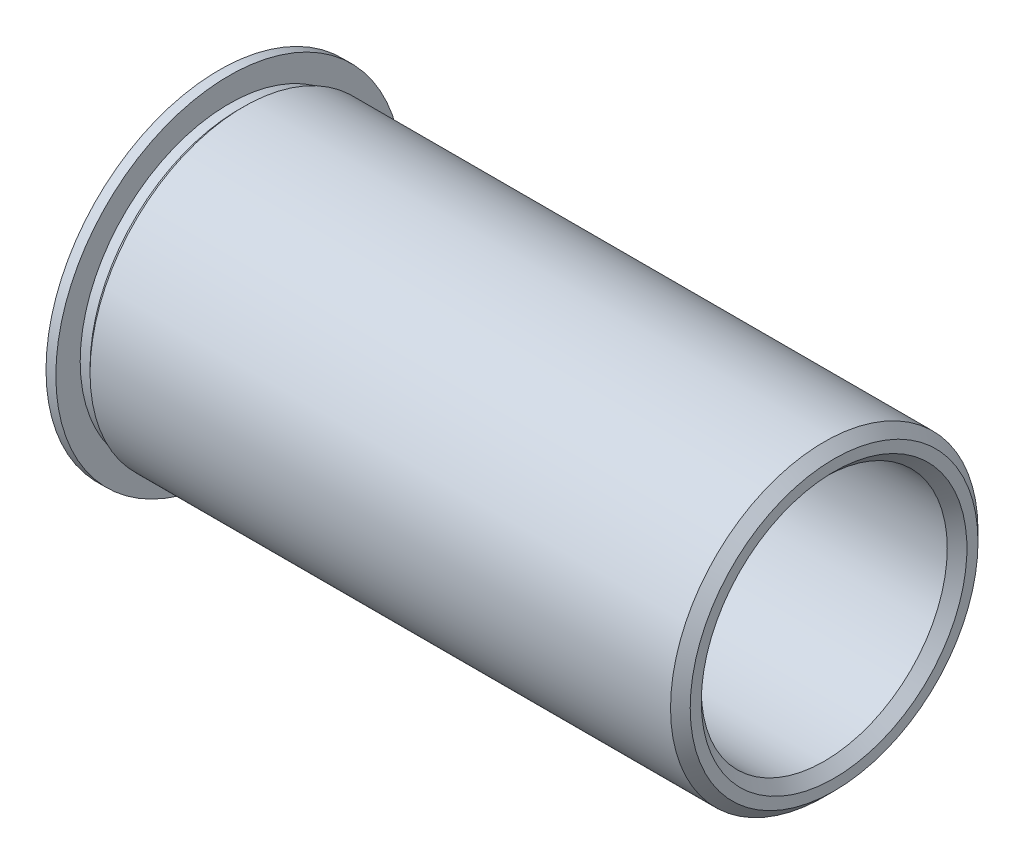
ISO-10303-21;
HEADER;
FILE_DESCRIPTION(('STEP AP214'),'2;1');
FILE_NAME('part.step','',(''),(''),'','','');
FILE_SCHEMA(('AUTOMOTIVE_DESIGN { 1 0 10303 214 1 1 1 1 }'));
ENDSEC;
DATA;
#1=APPLICATION_CONTEXT('core data for automotive mechanical design processes');
#2=APPLICATION_PROTOCOL_DEFINITION('international standard','automotive_design',2000,#1);
#3=PRODUCT_CONTEXT('',#1,'mechanical');
#4=PRODUCT('Part','Part','',(#3));
#5=PRODUCT_RELATED_PRODUCT_CATEGORY('part','',(#4));
#6=PRODUCT_DEFINITION_FORMATION('','',#4);
#7=PRODUCT_DEFINITION_CONTEXT('part definition',#1,'design');
#8=PRODUCT_DEFINITION('design','',#6,#7);
#9=PRODUCT_DEFINITION_SHAPE('','',#8);
#10=(LENGTH_UNIT() NAMED_UNIT(*) SI_UNIT(.MILLI.,.METRE.));
#11=(NAMED_UNIT(*) PLANE_ANGLE_UNIT() SI_UNIT($,.RADIAN.));
#12=(NAMED_UNIT(*) SI_UNIT($,.STERADIAN.) SOLID_ANGLE_UNIT());
#13=UNCERTAINTY_MEASURE_WITH_UNIT(LENGTH_MEASURE(1.E-05),#10,'distance_accuracy_value','');
#14=(GEOMETRIC_REPRESENTATION_CONTEXT(3) GLOBAL_UNCERTAINTY_ASSIGNED_CONTEXT((#13)) GLOBAL_UNIT_ASSIGNED_CONTEXT((#10,
#11,#12)) REPRESENTATION_CONTEXT('',''));
#15=CARTESIAN_POINT('',(0.,0.,0.));
#16=DIRECTION('',(0.,0.,1.));
#17=DIRECTION('',(1.,0.,0.));
#18=AXIS2_PLACEMENT_3D('',#15,#16,#17);
#19=CARTESIAN_POINT('',(-45.0910828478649,94.6526873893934,0.));
#20=DIRECTION('',(-1.,0.,0.));
#21=DIRECTION('',(0.,0.,1.));
#22=AXIS2_PLACEMENT_3D('',#19,#20,#21);
#23=PLANE('',#22);
#24=CARTESIAN_POINT('',(-45.0910828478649,94.6526873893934,0.));
#25=DIRECTION('',(-1.,0.,0.));
#26=DIRECTION('',(0.,0.,1.));
#27=AXIS2_PLACEMENT_3D('',#24,#25,#26);
#28=CIRCLE('',#27,3.429);
#29=CARTESIAN_POINT('',(-45.0910828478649,94.6526873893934,3.429));
#30=VERTEX_POINT('',#29);
#31=EDGE_CURVE('E10',#30,#30,#28,.T.);
#32=ORIENTED_EDGE('',*,*,#31,.T.);
#33=EDGE_LOOP('',(#32));
#34=FACE_BOUND('',#33,.T.);
#35=CARTESIAN_POINT('',(-45.0910828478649,94.6526873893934,0.));
#36=DIRECTION('',(-1.,0.,0.));
#37=DIRECTION('',(0.,0.,1.));
#38=AXIS2_PLACEMENT_3D('',#35,#36,#37);
#39=CIRCLE('',#38,3.71475);
#40=CARTESIAN_POINT('',(-45.0910828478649,94.6526873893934,3.71475));
#41=VERTEX_POINT('',#40);
#42=EDGE_CURVE('E53',#41,#41,#39,.T.);
#43=ORIENTED_EDGE('',*,*,#42,.F.);
#44=EDGE_LOOP('',(#43));
#45=FACE_BOUND('',#44,.T.);
#46=ADVANCED_FACE('F33',(#34,#45),#23,.F.);
#47=CARTESIAN_POINT('',(-45.0910828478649,94.6526873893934,0.));
#48=DIRECTION('',(-1.,0.,0.));
#49=DIRECTION('',(0.,0.,1.));
#50=AXIS2_PLACEMENT_3D('',#47,#48,#49);
#51=CONICAL_SURFACE('',#50,3.71475,0.785398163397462);
#52=CARTESIAN_POINT('',(-45.3450828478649,94.6526873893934,0.));
#53=DIRECTION('',(-1.,0.,0.));
#54=DIRECTION('',(0.,0.,1.));
#55=AXIS2_PLACEMENT_3D('',#52,#53,#54);
#56=CIRCLE('',#55,3.96875000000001);
#57=CARTESIAN_POINT('',(-45.3450828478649,94.6526873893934,3.96875000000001));
#58=VERTEX_POINT('',#57);
#59=EDGE_CURVE('E56',#58,#58,#56,.T.);
#60=ORIENTED_EDGE('',*,*,#59,.F.);
#61=EDGE_LOOP('',(#60));
#62=FACE_BOUND('',#61,.T.);
#63=ORIENTED_EDGE('',*,*,#42,.T.);
#64=EDGE_LOOP('',(#63));
#65=FACE_BOUND('',#64,.T.);
#66=ADVANCED_FACE('F104',(#62,#65),#51,.T.);
#67=CARTESIAN_POINT('',(-60.9660828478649,94.6526873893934,0.));
#68=DIRECTION('',(-1.,0.,0.));
#69=DIRECTION('',(0.,0.,1.));
#70=AXIS2_PLACEMENT_3D('',#67,#68,#69);
#71=CYLINDRICAL_SURFACE('',#70,3.96875000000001);
#72=CARTESIAN_POINT('',(-60.331082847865,94.6526873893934,0.));
#73=DIRECTION('',(-1.,0.,0.));
#74=DIRECTION('',(0.,0.,1.));
#75=AXIS2_PLACEMENT_3D('',#72,#73,#74);
#76=CIRCLE('',#75,3.96875000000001);
#77=CARTESIAN_POINT('',(-60.331082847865,94.6526873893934,3.96875000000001));
#78=VERTEX_POINT('',#77);
#79=EDGE_CURVE('E59',#78,#78,#76,.T.);
#80=ORIENTED_EDGE('',*,*,#79,.F.);
#81=EDGE_LOOP('',(#80));
#82=FACE_BOUND('',#81,.T.);
#83=ORIENTED_EDGE('',*,*,#59,.T.);
#84=EDGE_LOOP('',(#83));
#85=FACE_BOUND('',#84,.T.);
#86=ADVANCED_FACE('F98',(#82,#85),#71,.T.);
#87=CARTESIAN_POINT('',(-60.331082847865,94.6526873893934,0.));
#88=DIRECTION('',(1.,0.,0.));
#89=DIRECTION('',(0.,0.,-1.));
#90=AXIS2_PLACEMENT_3D('',#87,#88,#89);
#91=CONICAL_SURFACE('',#90,3.96875000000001,0.785398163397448);
#92=CARTESIAN_POINT('',(-60.458082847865,94.6526873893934,0.));
#93=DIRECTION('',(-1.,0.,0.));
#94=DIRECTION('',(0.,0.,1.));
#95=AXIS2_PLACEMENT_3D('',#92,#93,#94);
#96=CIRCLE('',#95,3.84175);
#97=CARTESIAN_POINT('',(-60.458082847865,94.6526873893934,3.84175));
#98=VERTEX_POINT('',#97);
#99=EDGE_CURVE('E62',#98,#98,#96,.T.);
#100=ORIENTED_EDGE('',*,*,#99,.F.);
#101=EDGE_LOOP('',(#100));
#102=FACE_BOUND('',#101,.T.);
#103=ORIENTED_EDGE('',*,*,#79,.T.);
#104=EDGE_LOOP('',(#103));
#105=FACE_BOUND('',#104,.T.);
#106=ADVANCED_FACE('F92',(#102,#105),#91,.T.);
#107=CARTESIAN_POINT('',(-60.9660828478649,94.6526873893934,0.));
#108=DIRECTION('',(-1.,0.,0.));
#109=DIRECTION('',(0.,0.,1.));
#110=AXIS2_PLACEMENT_3D('',#107,#108,#109);
#111=CYLINDRICAL_SURFACE('',#110,3.84175);
#112=CARTESIAN_POINT('',(-60.712082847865,94.6526873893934,0.));
#113=DIRECTION('',(-1.,0.,0.));
#114=DIRECTION('',(0.,0.,1.));
#115=AXIS2_PLACEMENT_3D('',#112,#113,#114);
#116=CIRCLE('',#115,3.84175);
#117=CARTESIAN_POINT('',(-60.712082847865,94.6526873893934,3.84175));
#118=VERTEX_POINT('',#117);
#119=EDGE_CURVE('E65',#118,#118,#116,.T.);
#120=ORIENTED_EDGE('',*,*,#119,.F.);
#121=EDGE_LOOP('',(#120));
#122=FACE_BOUND('',#121,.T.);
#123=ORIENTED_EDGE('',*,*,#99,.T.);
#124=EDGE_LOOP('',(#123));
#125=FACE_BOUND('',#124,.T.);
#126=ADVANCED_FACE('F86',(#122,#125),#111,.T.);
#127=CARTESIAN_POINT('',(-60.712082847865,98.4944373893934,0.));
#128=DIRECTION('',(-1.,0.,0.));
#129=DIRECTION('',(0.,0.,1.));
#130=AXIS2_PLACEMENT_3D('',#127,#128,#129);
#131=PLANE('',#130);
#132=CARTESIAN_POINT('',(-60.712082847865,94.6526873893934,0.));
#133=DIRECTION('',(-1.,0.,0.));
#134=DIRECTION('',(0.,0.,1.));
#135=AXIS2_PLACEMENT_3D('',#132,#133,#134);
#136=CIRCLE('',#135,4.47040000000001);
#137=CARTESIAN_POINT('',(-60.712082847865,94.6526873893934,4.47040000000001));
#138=VERTEX_POINT('',#137);
#139=EDGE_CURVE('E68',#138,#138,#136,.T.);
#140=ORIENTED_EDGE('',*,*,#139,.F.);
#141=EDGE_LOOP('',(#140));
#142=FACE_BOUND('',#141,.T.);
#143=ORIENTED_EDGE('',*,*,#119,.T.);
#144=EDGE_LOOP('',(#143));
#145=FACE_BOUND('',#144,.T.);
#146=ADVANCED_FACE('F80',(#142,#145),#131,.F.);
#147=CARTESIAN_POINT('',(-60.9660828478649,94.6526873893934,0.));
#148=DIRECTION('',(-1.,0.,0.));
#149=DIRECTION('',(0.,0.,1.));
#150=AXIS2_PLACEMENT_3D('',#147,#148,#149);
#151=CYLINDRICAL_SURFACE('',#150,4.47040000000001);
#152=CARTESIAN_POINT('',(-60.9660828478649,94.6526873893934,0.));
#153=DIRECTION('',(-1.,0.,0.));
#154=DIRECTION('',(0.,0.,1.));
#155=AXIS2_PLACEMENT_3D('',#152,#153,#154);
#156=CIRCLE('',#155,4.4704);
#157=CARTESIAN_POINT('',(-60.9660828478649,94.6526873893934,4.4704));
#158=VERTEX_POINT('',#157);
#159=EDGE_CURVE('E71',#158,#158,#156,.T.);
#160=ORIENTED_EDGE('',*,*,#159,.F.);
#161=EDGE_LOOP('',(#160));
#162=FACE_BOUND('',#161,.T.);
#163=ORIENTED_EDGE('',*,*,#139,.T.);
#164=EDGE_LOOP('',(#163));
#165=FACE_BOUND('',#164,.T.);
#166=ADVANCED_FACE('F77',(#162,#165),#151,.T.);
#167=CARTESIAN_POINT('',(-60.9660828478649,94.6526873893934,0.));
#168=DIRECTION('',(1.,0.,0.));
#169=DIRECTION('',(0.,0.,-1.));
#170=AXIS2_PLACEMENT_3D('',#167,#168,#169);
#171=PLANE('',#170);
#172=CARTESIAN_POINT('',(-60.9660828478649,94.6526873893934,0.));
#173=DIRECTION('',(1.,0.,0.));
#174=DIRECTION('',(0.,0.,-1.));
#175=AXIS2_PLACEMENT_3D('',#172,#173,#174);
#176=CIRCLE('',#175,3.429);
#177=CARTESIAN_POINT('',(-60.9660828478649,94.6526873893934,-3.429));
#178=VERTEX_POINT('',#177);
#179=EDGE_CURVE('E48',#178,#178,#176,.T.);
#180=ORIENTED_EDGE('',*,*,#179,.T.);
#181=EDGE_LOOP('',(#180));
#182=FACE_BOUND('',#181,.T.);
#183=ORIENTED_EDGE('',*,*,#159,.T.);
#184=EDGE_LOOP('',(#183));
#185=FACE_BOUND('',#184,.T.);
#186=ADVANCED_FACE('F75',(#182,#185),#171,.F.);
#187=CARTESIAN_POINT('',(-60.9660828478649,94.6526873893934,0.));
#188=DIRECTION('',(1.,0.,0.));
#189=DIRECTION('',(0.,0.,-1.));
#190=AXIS2_PLACEMENT_3D('',#187,#188,#189);
#191=CYLINDRICAL_SURFACE('',#190,3.175);
#192=CARTESIAN_POINT('',(-45.345082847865,94.6526873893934,0.));
#193=DIRECTION('',(-1.,0.,0.));
#194=DIRECTION('',(0.,0.,1.));
#195=AXIS2_PLACEMENT_3D('',#192,#193,#194);
#196=CIRCLE('',#195,3.175);
#197=CARTESIAN_POINT('',(-45.345082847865,94.6526873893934,3.175));
#198=VERTEX_POINT('',#197);
#199=EDGE_CURVE('E40',#198,#198,#196,.F.);
#200=ORIENTED_EDGE('',*,*,#199,.T.);
#201=EDGE_LOOP('',(#200));
#202=FACE_BOUND('',#201,.T.);
#203=CARTESIAN_POINT('',(-60.712082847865,94.6526873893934,0.));
#204=DIRECTION('',(1.,0.,0.));
#205=DIRECTION('',(0.,0.,-1.));
#206=AXIS2_PLACEMENT_3D('',#203,#204,#205);
#207=CIRCLE('',#206,3.175);
#208=CARTESIAN_POINT('',(-60.712082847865,94.6526873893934,-3.175));
#209=VERTEX_POINT('',#208);
#210=EDGE_CURVE('E44',#209,#209,#207,.F.);
#211=ORIENTED_EDGE('',*,*,#210,.T.);
#212=EDGE_LOOP('',(#211));
#213=FACE_BOUND('',#212,.T.);
#214=ADVANCED_FACE('F119',(#202,#213),#191,.F.);
#215=CARTESIAN_POINT('',(-60.9660828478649,94.6526873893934,0.));
#216=DIRECTION('',(-1.,0.,0.));
#217=DIRECTION('',(0.,0.,1.));
#218=AXIS2_PLACEMENT_3D('',#215,#216,#217);
#219=CONICAL_SURFACE('',#218,3.429,0.785398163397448);
#220=ORIENTED_EDGE('',*,*,#210,.F.);
#221=EDGE_LOOP('',(#220));
#222=FACE_BOUND('',#221,.T.);
#223=ORIENTED_EDGE('',*,*,#179,.F.);
#224=EDGE_LOOP('',(#223));
#225=FACE_BOUND('',#224,.T.);
#226=ADVANCED_FACE('F117',(#222,#225),#219,.F.);
#227=CARTESIAN_POINT('',(-45.345082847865,94.6526873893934,0.));
#228=DIRECTION('',(1.,0.,0.));
#229=DIRECTION('',(0.,0.,-1.));
#230=AXIS2_PLACEMENT_3D('',#227,#228,#229);
#231=CONICAL_SURFACE('',#230,3.175,0.785398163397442);
#232=ORIENTED_EDGE('',*,*,#31,.F.);
#233=EDGE_LOOP('',(#232));
#234=FACE_BOUND('',#233,.T.);
#235=ORIENTED_EDGE('',*,*,#199,.F.);
#236=EDGE_LOOP('',(#235));
#237=FACE_BOUND('',#236,.T.);
#238=ADVANCED_FACE('F35',(#234,#237),#231,.F.);
#239=CLOSED_SHELL('',(#46,#66,#86,#106,#126,#146,#166,#186,#214,#226,#238));
#240=MANIFOLD_SOLID_BREP('B2',#239);
#241=ADVANCED_BREP_SHAPE_REPRESENTATION('',(#18,#240),#14);
#242=SHAPE_DEFINITION_REPRESENTATION(#9,#241);
ENDSEC;
END-ISO-10303-21;
